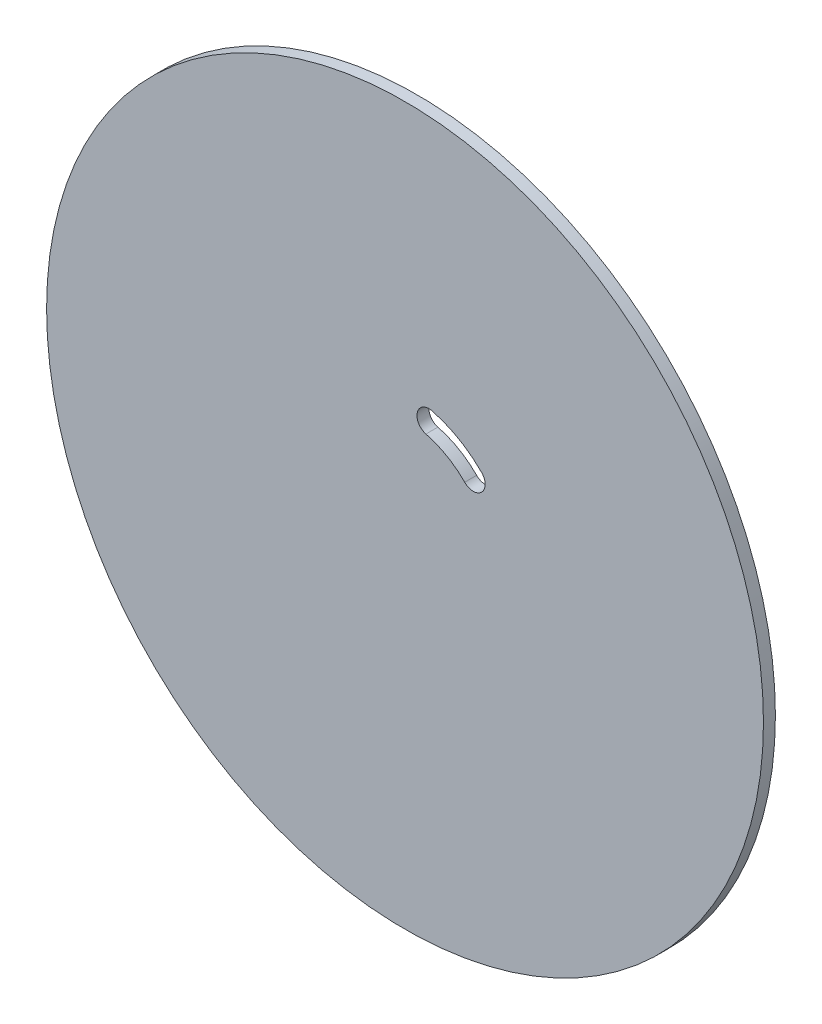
ISO-10303-21;
HEADER;
FILE_DESCRIPTION(('STEP AP214'),'2;1');
FILE_NAME('part.step','',(''),(''),'','','');
FILE_SCHEMA(('AUTOMOTIVE_DESIGN { 1 0 10303 214 1 1 1 1 }'));
ENDSEC;
DATA;
#1=APPLICATION_CONTEXT('core data for automotive mechanical design processes');
#2=APPLICATION_PROTOCOL_DEFINITION('international standard','automotive_design',2000,#1);
#3=PRODUCT_CONTEXT('',#1,'mechanical');
#4=PRODUCT('Part','Part','',(#3));
#5=PRODUCT_RELATED_PRODUCT_CATEGORY('part','',(#4));
#6=PRODUCT_DEFINITION_FORMATION('','',#4);
#7=PRODUCT_DEFINITION_CONTEXT('part definition',#1,'design');
#8=PRODUCT_DEFINITION('design','',#6,#7);
#9=PRODUCT_DEFINITION_SHAPE('','',#8);
#10=(LENGTH_UNIT() NAMED_UNIT(*) SI_UNIT(.MILLI.,.METRE.));
#11=(NAMED_UNIT(*) PLANE_ANGLE_UNIT() SI_UNIT($,.RADIAN.));
#12=(NAMED_UNIT(*) SI_UNIT($,.STERADIAN.) SOLID_ANGLE_UNIT());
#13=UNCERTAINTY_MEASURE_WITH_UNIT(LENGTH_MEASURE(1.E-05),#10,'distance_accuracy_value','');
#14=(GEOMETRIC_REPRESENTATION_CONTEXT(3) GLOBAL_UNCERTAINTY_ASSIGNED_CONTEXT((#13)) GLOBAL_UNIT_ASSIGNED_CONTEXT((#10,
#11,#12)) REPRESENTATION_CONTEXT('',''));
#15=CARTESIAN_POINT('',(0.,0.,0.));
#16=DIRECTION('',(0.,0.,1.));
#17=DIRECTION('',(1.,0.,0.));
#18=AXIS2_PLACEMENT_3D('',#15,#16,#17);
#19=CARTESIAN_POINT('',(0.,0.,6.35));
#20=DIRECTION('',(0.,0.,-1.));
#21=DIRECTION('',(-1.,0.,0.));
#22=AXIS2_PLACEMENT_3D('',#19,#20,#21);
#23=CYLINDRICAL_SURFACE('',#22,190.5);
#24=CARTESIAN_POINT('',(0.,0.,6.35));
#25=DIRECTION('',(0.,0.,1.));
#26=DIRECTION('',(1.,0.,0.));
#27=AXIS2_PLACEMENT_3D('',#24,#25,#26);
#28=CIRCLE('',#27,190.5);
#29=CARTESIAN_POINT('',(190.5,0.,6.35));
#30=VERTEX_POINT('',#29);
#31=EDGE_CURVE('E11',#30,#30,#28,.T.);
#32=ORIENTED_EDGE('',*,*,#31,.F.);
#33=EDGE_LOOP('',(#32));
#34=FACE_BOUND('',#33,.T.);
#35=CARTESIAN_POINT('',(0.,0.,0.));
#36=DIRECTION('',(0.,0.,1.));
#37=DIRECTION('',(1.,0.,0.));
#38=AXIS2_PLACEMENT_3D('',#35,#36,#37);
#39=CIRCLE('',#38,190.5);
#40=CARTESIAN_POINT('',(190.5,0.,0.));
#41=VERTEX_POINT('',#40);
#42=EDGE_CURVE('E35',#41,#41,#39,.T.);
#43=ORIENTED_EDGE('',*,*,#42,.T.);
#44=EDGE_LOOP('',(#43));
#45=FACE_BOUND('',#44,.T.);
#46=ADVANCED_FACE('F28',(#34,#45),#23,.T.);
#47=CARTESIAN_POINT('',(0.,0.,6.35));
#48=DIRECTION('',(0.,0.,1.));
#49=DIRECTION('',(1.,0.,0.));
#50=AXIS2_PLACEMENT_3D('',#47,#48,#49);
#51=PLANE('',#50);
#52=CARTESIAN_POINT('',(36.247094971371,35.5919668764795,6.35));
#53=DIRECTION('',(0.,0.,1.));
#54=DIRECTION('',(1.,0.,0.));
#55=AXIS2_PLACEMENT_3D('',#52,#53,#54);
#56=CIRCLE('',#55,6.35000000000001);
#57=CARTESIAN_POINT('',(31.7162080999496,31.1429710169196,6.35));
#58=VERTEX_POINT('',#57);
#59=CARTESIAN_POINT('',(40.7779818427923,40.0409627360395,6.35));
#60=VERTEX_POINT('',#59);
#61=EDGE_CURVE('E42',#58,#60,#56,.T.);
#62=ORIENTED_EDGE('',*,*,#61,.F.);
#63=CARTESIAN_POINT('',(0.,0.,6.35));
#64=DIRECTION('',(0.,0.,-1.));
#65=DIRECTION('',(-1.,0.,0.));
#66=AXIS2_PLACEMENT_3D('',#63,#64,#65);
#67=CIRCLE('',#66,44.45);
#68=CARTESIAN_POINT('',(11.1125,43.0385274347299,6.35));
#69=VERTEX_POINT('',#68);
#70=EDGE_CURVE('E86',#69,#58,#67,.T.);
#71=ORIENTED_EDGE('',*,*,#70,.F.);
#72=CARTESIAN_POINT('',(12.7,49.1868884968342,6.35));
#73=DIRECTION('',(0.,0.,1.));
#74=DIRECTION('',(-1.,0.,0.));
#75=AXIS2_PLACEMENT_3D('',#72,#73,#74);
#76=CIRCLE('',#75,6.35000000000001);
#77=CARTESIAN_POINT('',(14.2875,55.3352495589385,6.35));
#78=VERTEX_POINT('',#77);
#79=EDGE_CURVE('E70',#78,#69,#76,.T.);
#80=ORIENTED_EDGE('',*,*,#79,.F.);
#81=CARTESIAN_POINT('',(0.,0.,6.35));
#82=DIRECTION('',(0.,0.,1.));
#83=DIRECTION('',(-1.,0.,0.));
#84=AXIS2_PLACEMENT_3D('',#81,#82,#83);
#85=CIRCLE('',#84,57.15);
#86=EDGE_CURVE('E79',#60,#78,#85,.T.);
#87=ORIENTED_EDGE('',*,*,#86,.F.);
#88=EDGE_LOOP('',(#62,#71,#80,#87));
#89=FACE_BOUND('',#88,.T.);
#90=ORIENTED_EDGE('',*,*,#31,.T.);
#91=EDGE_LOOP('',(#90));
#92=FACE_BOUND('',#91,.T.);
#93=ADVANCED_FACE('F83',(#89,#92),#51,.T.);
#94=CARTESIAN_POINT('',(0.,0.,0.));
#95=DIRECTION('',(0.,0.,1.));
#96=DIRECTION('',(1.,0.,0.));
#97=AXIS2_PLACEMENT_3D('',#94,#95,#96);
#98=PLANE('',#97);
#99=CARTESIAN_POINT('',(0.,0.,0.));
#100=DIRECTION('',(0.,0.,-1.));
#101=DIRECTION('',(-1.,0.,0.));
#102=AXIS2_PLACEMENT_3D('',#99,#100,#101);
#103=CIRCLE('',#102,44.45);
#104=CARTESIAN_POINT('',(11.1125,43.0385274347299,0.));
#105=VERTEX_POINT('',#104);
#106=CARTESIAN_POINT('',(31.7162080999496,31.1429710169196,0.));
#107=VERTEX_POINT('',#106);
#108=EDGE_CURVE('E97',#105,#107,#103,.T.);
#109=ORIENTED_EDGE('',*,*,#108,.T.);
#110=CARTESIAN_POINT('',(36.247094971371,35.5919668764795,0.));
#111=DIRECTION('',(0.,0.,1.));
#112=DIRECTION('',(1.,0.,0.));
#113=AXIS2_PLACEMENT_3D('',#110,#111,#112);
#114=CIRCLE('',#113,6.35000000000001);
#115=CARTESIAN_POINT('',(40.7779818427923,40.0409627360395,0.));
#116=VERTEX_POINT('',#115);
#117=EDGE_CURVE('E88',#107,#116,#114,.T.);
#118=ORIENTED_EDGE('',*,*,#117,.T.);
#119=CARTESIAN_POINT('',(0.,0.,0.));
#120=DIRECTION('',(0.,0.,1.));
#121=DIRECTION('',(-1.,0.,0.));
#122=AXIS2_PLACEMENT_3D('',#119,#120,#121);
#123=CIRCLE('',#122,57.15);
#124=CARTESIAN_POINT('',(14.2875,55.3352495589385,0.));
#125=VERTEX_POINT('',#124);
#126=EDGE_CURVE('E94',#116,#125,#123,.T.);
#127=ORIENTED_EDGE('',*,*,#126,.T.);
#128=CARTESIAN_POINT('',(12.7,49.1868884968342,0.));
#129=DIRECTION('',(0.,0.,1.));
#130=DIRECTION('',(-1.,0.,0.));
#131=AXIS2_PLACEMENT_3D('',#128,#129,#130);
#132=CIRCLE('',#131,6.35000000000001);
#133=EDGE_CURVE('E50',#125,#105,#132,.T.);
#134=ORIENTED_EDGE('',*,*,#133,.T.);
#135=EDGE_LOOP('',(#109,#118,#127,#134));
#136=FACE_BOUND('',#135,.T.);
#137=ORIENTED_EDGE('',*,*,#42,.F.);
#138=EDGE_LOOP('',(#137));
#139=FACE_BOUND('',#138,.T.);
#140=ADVANCED_FACE('F107',(#136,#139),#98,.F.);
#141=CARTESIAN_POINT('',(36.247094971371,35.5919668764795,0.));
#142=DIRECTION('',(0.,0.,1.));
#143=DIRECTION('',(1.,0.,0.));
#144=AXIS2_PLACEMENT_3D('',#141,#142,#143);
#145=CYLINDRICAL_SURFACE('',#144,6.35000000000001);
#146=ORIENTED_EDGE('',*,*,#61,.T.);
#147=DIRECTION('',(0.,0.,1.));
#148=VECTOR('',#147,1.);
#149=CARTESIAN_POINT('',(40.7779818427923,40.0409627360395,0.));
#150=LINE('',#149,#148);
#151=EDGE_CURVE('E76',#116,#60,#150,.T.);
#152=ORIENTED_EDGE('',*,*,#151,.F.);
#153=ORIENTED_EDGE('',*,*,#117,.F.);
#154=DIRECTION('',(0.,0.,1.));
#155=VECTOR('',#154,1.);
#156=CARTESIAN_POINT('',(31.7162080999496,31.1429710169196,0.));
#157=LINE('',#156,#155);
#158=EDGE_CURVE('E100',#107,#58,#157,.T.);
#159=ORIENTED_EDGE('',*,*,#158,.T.);
#160=EDGE_LOOP('',(#146,#152,#153,#159));
#161=FACE_BOUND('',#160,.T.);
#162=ADVANCED_FACE('F109',(#161),#145,.F.);
#163=CARTESIAN_POINT('',(0.,0.,0.));
#164=DIRECTION('',(0.,0.,1.));
#165=DIRECTION('',(1.,0.,0.));
#166=AXIS2_PLACEMENT_3D('',#163,#164,#165);
#167=CYLINDRICAL_SURFACE('',#166,44.45);
#168=ORIENTED_EDGE('',*,*,#70,.T.);
#169=ORIENTED_EDGE('',*,*,#158,.F.);
#170=ORIENTED_EDGE('',*,*,#108,.F.);
#171=DIRECTION('',(0.,0.,1.));
#172=VECTOR('',#171,1.);
#173=CARTESIAN_POINT('',(11.1125,43.0385274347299,0.));
#174=LINE('',#173,#172);
#175=EDGE_CURVE('E75',#105,#69,#174,.T.);
#176=ORIENTED_EDGE('',*,*,#175,.T.);
#177=EDGE_LOOP('',(#168,#169,#170,#176));
#178=FACE_BOUND('',#177,.T.);
#179=ADVANCED_FACE('F116',(#178),#167,.T.);
#180=CARTESIAN_POINT('',(12.7,49.1868884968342,0.));
#181=DIRECTION('',(0.,0.,1.));
#182=DIRECTION('',(1.,0.,0.));
#183=AXIS2_PLACEMENT_3D('',#180,#181,#182);
#184=CYLINDRICAL_SURFACE('',#183,6.35000000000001);
#185=ORIENTED_EDGE('',*,*,#79,.T.);
#186=ORIENTED_EDGE('',*,*,#175,.F.);
#187=ORIENTED_EDGE('',*,*,#133,.F.);
#188=DIRECTION('',(0.,0.,1.));
#189=VECTOR('',#188,1.);
#190=CARTESIAN_POINT('',(14.2875,55.3352495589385,0.));
#191=LINE('',#190,#189);
#192=EDGE_CURVE('E66',#125,#78,#191,.T.);
#193=ORIENTED_EDGE('',*,*,#192,.T.);
#194=EDGE_LOOP('',(#185,#186,#187,#193));
#195=FACE_BOUND('',#194,.T.);
#196=ADVANCED_FACE('F68',(#195),#184,.F.);
#197=CARTESIAN_POINT('',(0.,0.,0.));
#198=DIRECTION('',(0.,0.,1.));
#199=DIRECTION('',(1.,0.,0.));
#200=AXIS2_PLACEMENT_3D('',#197,#198,#199);
#201=CYLINDRICAL_SURFACE('',#200,57.15);
#202=ORIENTED_EDGE('',*,*,#86,.T.);
#203=ORIENTED_EDGE('',*,*,#192,.F.);
#204=ORIENTED_EDGE('',*,*,#126,.F.);
#205=ORIENTED_EDGE('',*,*,#151,.T.);
#206=EDGE_LOOP('',(#202,#203,#204,#205));
#207=FACE_BOUND('',#206,.T.);
#208=ADVANCED_FACE('F80',(#207),#201,.F.);
#209=CLOSED_SHELL('',(#46,#93,#140,#162,#179,#196,#208));
#210=MANIFOLD_SOLID_BREP('B2',#209);
#211=ADVANCED_BREP_SHAPE_REPRESENTATION('',(#18,#210),#14);
#212=SHAPE_DEFINITION_REPRESENTATION(#9,#211);
ENDSEC;
END-ISO-10303-21;
